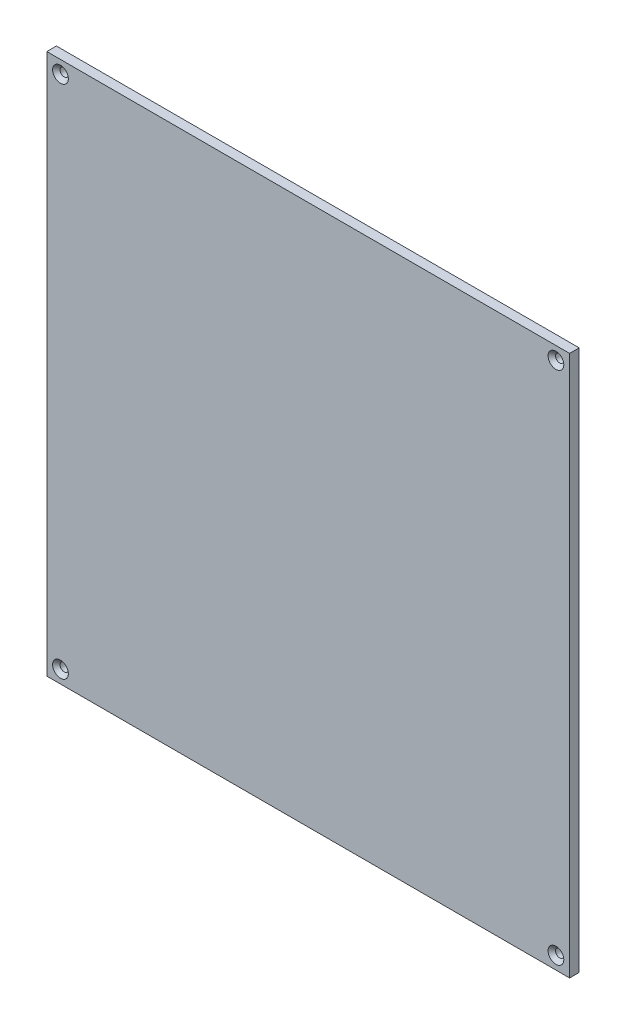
from build123d import *

# Parameters (mm, degrees)
MODEL_W                                         = 346
MODEL_H                                         = 358
BOSS_EXTRUDE1_DEPTH                             = 6.35
CUT_EXTRUDE1_REACH                              = 251.019
SKETCH2_R                                       = 2.55
CSK_FOR_M5_FLAT_HEAD_MACHINE_SCREW1_D           = 5.5
CSK_FOR_M5_FLAT_HEAD_MACHINE_SCREW1_CSINK_D     = 10.4
CSK_FOR_M5_FLAT_HEAD_MACHINE_SCREW1_CSINK_ANGLE = 90


with BuildPart() as part:
    # Model → Boss-Extrude1 (new body)
    with BuildSketch(Plane.XY):
        Rectangle(MODEL_W, MODEL_H)
    extrude(amount=BOSS_EXTRUDE1_DEPTH)

    # Sketch2 → Cut-Extrude1 (cut, up to next)
    with BuildSketch(Plane.XY.offset(6.35), mode=Mode.PRIVATE) as cut_extrude1_sk1:
        with Locations((-163.95, 170.5)):
            Circle(SKETCH2_R)
    cut_extrude1_tool1 = extrude(cut_extrude1_sk1.sketch, amount=-CUT_EXTRUDE1_REACH, mode=Mode.PRIVATE) & part.part
    # Sketch2 → Cut-Extrude1 (cut, up to next)
    with BuildSketch(Plane.XY.offset(6.35), mode=Mode.PRIVATE) as cut_extrude1_sk2:
        with Locations((-163.95, -170.5)):
            Circle(SKETCH2_R)
    cut_extrude1_tool2 = extrude(cut_extrude1_sk2.sketch, amount=-CUT_EXTRUDE1_REACH, mode=Mode.PRIVATE) & part.part
    # Sketch2 → Cut-Extrude1 (cut, up to next)
    with BuildSketch(Plane.XY.offset(6.35), mode=Mode.PRIVATE) as cut_extrude1_sk3:
        with Locations((163.95, -170.5)):
            Circle(SKETCH2_R)
    cut_extrude1_tool3 = extrude(cut_extrude1_sk3.sketch, amount=-CUT_EXTRUDE1_REACH, mode=Mode.PRIVATE) & part.part
    # Sketch2 → Cut-Extrude1 (cut, up to next)
    with BuildSketch(Plane.XY.offset(6.35), mode=Mode.PRIVATE) as cut_extrude1_sk4:
        with Locations((163.95, 170.5)):
            Circle(SKETCH2_R)
    cut_extrude1_tool4 = extrude(cut_extrude1_sk4.sketch, amount=-CUT_EXTRUDE1_REACH, mode=Mode.PRIVATE) & part.part
    add(cut_extrude1_tool1.solids().sort_by_distance((-163.95, 170.5, 6.35))[0], mode=Mode.SUBTRACT)
    add(cut_extrude1_tool2.solids().sort_by_distance((-163.95, -170.5, 6.35))[0], mode=Mode.SUBTRACT)
    add(cut_extrude1_tool3.solids().sort_by_distance((163.95, -170.5, 6.35))[0], mode=Mode.SUBTRACT)
    add(cut_extrude1_tool4.solids().sort_by_distance((163.95, 170.5, 6.35))[0], mode=Mode.SUBTRACT)

    # CSK for M5 Flat Head Machine Screw1 (through all)
    with Locations(Plane.XY.offset(6.35)):
        with Locations((-163.95, 170.5), (163.95, 170.5), (163.95, -170.5), (-163.95, -170.5)):
            CounterSinkHole(CSK_FOR_M5_FLAT_HEAD_MACHINE_SCREW1_D / 2, CSK_FOR_M5_FLAT_HEAD_MACHINE_SCREW1_CSINK_D / 2, counter_sink_angle=CSK_FOR_M5_FLAT_HEAD_MACHINE_SCREW1_CSINK_ANGLE)


solid = part.part
